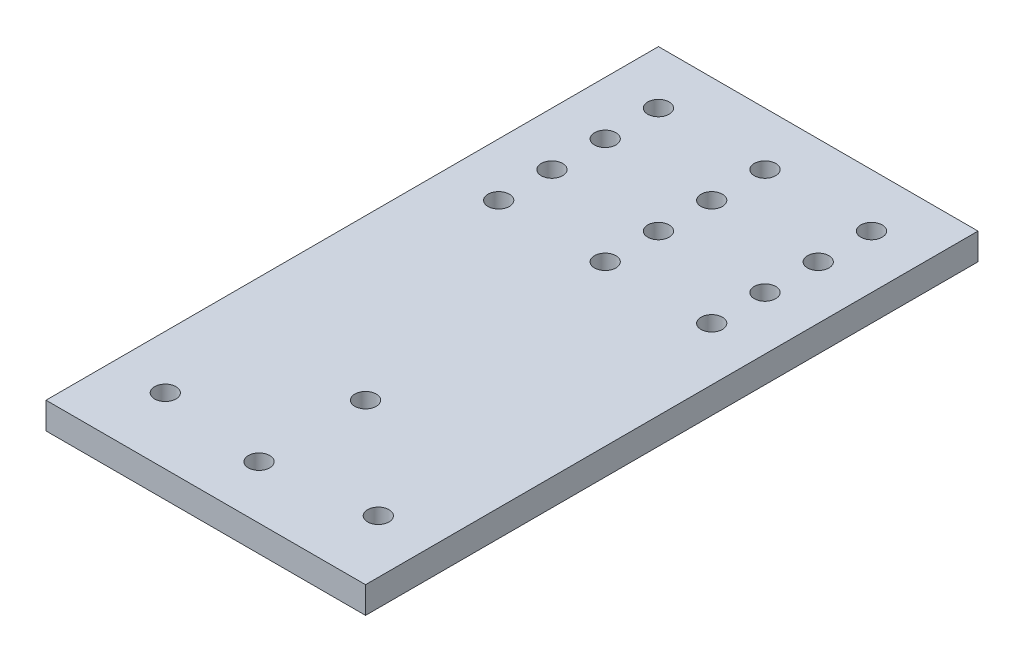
ISO-10303-21;
HEADER;
FILE_DESCRIPTION(('STEP AP214'),'2;1');
FILE_NAME('part.step','',(''),(''),'','','');
FILE_SCHEMA(('AUTOMOTIVE_DESIGN { 1 0 10303 214 1 1 1 1 }'));
ENDSEC;
DATA;
#1=APPLICATION_CONTEXT('core data for automotive mechanical design processes');
#2=APPLICATION_PROTOCOL_DEFINITION('international standard','automotive_design',2000,#1);
#3=PRODUCT_CONTEXT('',#1,'mechanical');
#4=PRODUCT('Part','Part','',(#3));
#5=PRODUCT_RELATED_PRODUCT_CATEGORY('part','',(#4));
#6=PRODUCT_DEFINITION_FORMATION('','',#4);
#7=PRODUCT_DEFINITION_CONTEXT('part definition',#1,'design');
#8=PRODUCT_DEFINITION('design','',#6,#7);
#9=PRODUCT_DEFINITION_SHAPE('','',#8);
#10=(LENGTH_UNIT() NAMED_UNIT(*) SI_UNIT(.MILLI.,.METRE.));
#11=(NAMED_UNIT(*) PLANE_ANGLE_UNIT() SI_UNIT($,.RADIAN.));
#12=(NAMED_UNIT(*) SI_UNIT($,.STERADIAN.) SOLID_ANGLE_UNIT());
#13=UNCERTAINTY_MEASURE_WITH_UNIT(LENGTH_MEASURE(1.E-05),#10,'distance_accuracy_value','');
#14=(GEOMETRIC_REPRESENTATION_CONTEXT(3) GLOBAL_UNCERTAINTY_ASSIGNED_CONTEXT((#13)) GLOBAL_UNIT_ASSIGNED_CONTEXT((#10,
#11,#12)) REPRESENTATION_CONTEXT('',''));
#15=CARTESIAN_POINT('',(0.,0.,0.));
#16=DIRECTION('',(0.,0.,1.));
#17=DIRECTION('',(1.,0.,0.));
#18=AXIS2_PLACEMENT_3D('',#15,#16,#17);
#19=CARTESIAN_POINT('',(38.1,6.35,73.025));
#20=DIRECTION('',(-1.,0.,0.));
#21=DIRECTION('',(0.,0.,1.));
#22=AXIS2_PLACEMENT_3D('',#19,#20,#21);
#23=PLANE('',#22);
#24=DIRECTION('',(0.,0.,-1.));
#25=VECTOR('',#24,1.);
#26=CARTESIAN_POINT('',(38.1,0.,73.025));
#27=LINE('',#26,#25);
#28=CARTESIAN_POINT('',(38.1,0.,73.025));
#29=VERTEX_POINT('',#28);
#30=CARTESIAN_POINT('',(38.1,0.,-73.025));
#31=VERTEX_POINT('',#30);
#32=EDGE_CURVE('E100',#29,#31,#27,.T.);
#33=ORIENTED_EDGE('',*,*,#32,.T.);
#34=DIRECTION('',(0.,-1.,0.));
#35=VECTOR('',#34,1.);
#36=CARTESIAN_POINT('',(38.1,6.35,-73.025));
#37=LINE('',#36,#35);
#38=CARTESIAN_POINT('',(38.1,6.35,-73.025));
#39=VERTEX_POINT('',#38);
#40=EDGE_CURVE('E11',#39,#31,#37,.T.);
#41=ORIENTED_EDGE('',*,*,#40,.F.);
#42=DIRECTION('',(0.,0.,-1.));
#43=VECTOR('',#42,1.);
#44=CARTESIAN_POINT('',(38.1,6.35,73.025));
#45=LINE('',#44,#43);
#46=CARTESIAN_POINT('',(38.1,6.35,73.025));
#47=VERTEX_POINT('',#46);
#48=EDGE_CURVE('E88',#47,#39,#45,.T.);
#49=ORIENTED_EDGE('',*,*,#48,.F.);
#50=DIRECTION('',(0.,-1.,0.));
#51=VECTOR('',#50,1.);
#52=CARTESIAN_POINT('',(38.1,6.35,73.025));
#53=LINE('',#52,#51);
#54=EDGE_CURVE('E96',#47,#29,#53,.T.);
#55=ORIENTED_EDGE('',*,*,#54,.T.);
#56=EDGE_LOOP('',(#33,#41,#49,#55));
#57=FACE_BOUND('',#56,.T.);
#58=ADVANCED_FACE('F37',(#57),#23,.F.);
#59=CARTESIAN_POINT('',(-38.1,6.35,-73.025));
#60=DIRECTION('',(0.,0.,1.));
#61=DIRECTION('',(1.,0.,0.));
#62=AXIS2_PLACEMENT_3D('',#59,#60,#61);
#63=PLANE('',#62);
#64=DIRECTION('',(-1.,0.,0.));
#65=VECTOR('',#64,1.);
#66=CARTESIAN_POINT('',(-38.1,0.,-73.025));
#67=LINE('',#66,#65);
#68=CARTESIAN_POINT('',(-38.1,0.,-73.025));
#69=VERTEX_POINT('',#68);
#70=EDGE_CURVE('E92',#31,#69,#67,.T.);
#71=ORIENTED_EDGE('',*,*,#70,.T.);
#72=DIRECTION('',(0.,-1.,0.));
#73=VECTOR('',#72,1.);
#74=CARTESIAN_POINT('',(-38.1,6.35,-73.025));
#75=LINE('',#74,#73);
#76=CARTESIAN_POINT('',(-38.1,6.35,-73.025));
#77=VERTEX_POINT('',#76);
#78=EDGE_CURVE('E45',#77,#69,#75,.T.);
#79=ORIENTED_EDGE('',*,*,#78,.F.);
#80=DIRECTION('',(-1.,0.,0.));
#81=VECTOR('',#80,1.);
#82=CARTESIAN_POINT('',(-38.1,6.35,-73.025));
#83=LINE('',#82,#81);
#84=EDGE_CURVE('E83',#39,#77,#83,.T.);
#85=ORIENTED_EDGE('',*,*,#84,.F.);
#86=ORIENTED_EDGE('',*,*,#40,.T.);
#87=EDGE_LOOP('',(#71,#79,#85,#86));
#88=FACE_BOUND('',#87,.T.);
#89=ADVANCED_FACE('F91',(#88),#63,.F.);
#90=CARTESIAN_POINT('',(-38.1,6.35,73.025));
#91=DIRECTION('',(1.,0.,0.));
#92=DIRECTION('',(0.,0.,-1.));
#93=AXIS2_PLACEMENT_3D('',#90,#91,#92);
#94=PLANE('',#93);
#95=DIRECTION('',(0.,0.,1.));
#96=VECTOR('',#95,1.);
#97=CARTESIAN_POINT('',(-38.1,0.,73.025));
#98=LINE('',#97,#96);
#99=CARTESIAN_POINT('',(-38.1,0.,73.025));
#100=VERTEX_POINT('',#99);
#101=EDGE_CURVE('E70',#69,#100,#98,.T.);
#102=ORIENTED_EDGE('',*,*,#101,.T.);
#103=DIRECTION('',(0.,-1.,0.));
#104=VECTOR('',#103,1.);
#105=CARTESIAN_POINT('',(-38.1,6.35,73.025));
#106=LINE('',#105,#104);
#107=CARTESIAN_POINT('',(-38.1,6.35,73.025));
#108=VERTEX_POINT('',#107);
#109=EDGE_CURVE('E93',#108,#100,#106,.T.);
#110=ORIENTED_EDGE('',*,*,#109,.F.);
#111=DIRECTION('',(0.,0.,1.));
#112=VECTOR('',#111,1.);
#113=CARTESIAN_POINT('',(-38.1,6.35,73.025));
#114=LINE('',#113,#112);
#115=EDGE_CURVE('E86',#77,#108,#114,.T.);
#116=ORIENTED_EDGE('',*,*,#115,.F.);
#117=ORIENTED_EDGE('',*,*,#78,.T.);
#118=EDGE_LOOP('',(#102,#110,#116,#117));
#119=FACE_BOUND('',#118,.T.);
#120=ADVANCED_FACE('F94',(#119),#94,.F.);
#121=CARTESIAN_POINT('',(-38.1,6.35,73.025));
#122=DIRECTION('',(0.,0.,-1.));
#123=DIRECTION('',(-1.,0.,0.));
#124=AXIS2_PLACEMENT_3D('',#121,#122,#123);
#125=PLANE('',#124);
#126=DIRECTION('',(1.,0.,0.));
#127=VECTOR('',#126,1.);
#128=CARTESIAN_POINT('',(-38.1,0.,73.025));
#129=LINE('',#128,#127);
#130=EDGE_CURVE('E76',#100,#29,#129,.T.);
#131=ORIENTED_EDGE('',*,*,#130,.T.);
#132=ORIENTED_EDGE('',*,*,#54,.F.);
#133=DIRECTION('',(1.,0.,0.));
#134=VECTOR('',#133,1.);
#135=CARTESIAN_POINT('',(-38.1,6.35,73.025));
#136=LINE('',#135,#134);
#137=EDGE_CURVE('E53',#108,#47,#136,.T.);
#138=ORIENTED_EDGE('',*,*,#137,.F.);
#139=ORIENTED_EDGE('',*,*,#109,.T.);
#140=EDGE_LOOP('',(#131,#132,#138,#139));
#141=FACE_BOUND('',#140,.T.);
#142=ADVANCED_FACE('F108',(#141),#125,.F.);
#143=CARTESIAN_POINT('',(0.,6.35,0.));
#144=DIRECTION('',(0.,-1.,0.));
#145=DIRECTION('',(0.,0.,-1.));
#146=AXIS2_PLACEMENT_3D('',#143,#144,#145);
#147=PLANE('',#146);
#148=CARTESIAN_POINT('',(0.,6.35,60.325));
#149=DIRECTION('',(0.,1.,0.));
#150=DIRECTION('',(0.,0.,1.));
#151=AXIS2_PLACEMENT_3D('',#148,#149,#150);
#152=CIRCLE('',#151,2.5527);
#153=CARTESIAN_POINT('',(0.,6.35,62.8777));
#154=VERTEX_POINT('',#153);
#155=EDGE_CURVE('E206',#154,#154,#152,.T.);
#156=ORIENTED_EDGE('',*,*,#155,.F.);
#157=EDGE_LOOP('',(#156));
#158=FACE_BOUND('',#157,.T.);
#159=CARTESIAN_POINT('',(0.,6.35,34.925));
#160=DIRECTION('',(0.,1.,0.));
#161=DIRECTION('',(0.,0.,1.));
#162=AXIS2_PLACEMENT_3D('',#159,#160,#161);
#163=CIRCLE('',#162,2.5527);
#164=CARTESIAN_POINT('',(0.,6.35,37.4777));
#165=VERTEX_POINT('',#164);
#166=EDGE_CURVE('E200',#165,#165,#163,.T.);
#167=ORIENTED_EDGE('',*,*,#166,.F.);
#168=EDGE_LOOP('',(#167));
#169=FACE_BOUND('',#168,.T.);
#170=CARTESIAN_POINT('',(-25.4,6.35,57.277));
#171=DIRECTION('',(0.,1.,0.));
#172=DIRECTION('',(0.,0.,1.));
#173=AXIS2_PLACEMENT_3D('',#170,#171,#172);
#174=CIRCLE('',#173,2.5527);
#175=CARTESIAN_POINT('',(-25.4,6.35,59.8297));
#176=VERTEX_POINT('',#175);
#177=EDGE_CURVE('E194',#176,#176,#174,.T.);
#178=ORIENTED_EDGE('',*,*,#177,.F.);
#179=EDGE_LOOP('',(#178));
#180=FACE_BOUND('',#179,.T.);
#181=CARTESIAN_POINT('',(25.4,6.35,57.277));
#182=DIRECTION('',(0.,1.,0.));
#183=DIRECTION('',(0.,0.,1.));
#184=AXIS2_PLACEMENT_3D('',#181,#182,#183);
#185=CIRCLE('',#184,2.5527);
#186=CARTESIAN_POINT('',(25.4,6.35,59.8297));
#187=VERTEX_POINT('',#186);
#188=EDGE_CURVE('E188',#187,#187,#185,.T.);
#189=ORIENTED_EDGE('',*,*,#188,.F.);
#190=EDGE_LOOP('',(#189));
#191=FACE_BOUND('',#190,.T.);
#192=CARTESIAN_POINT('',(0.,6.35,-22.225));
#193=DIRECTION('',(0.,1.,0.));
#194=DIRECTION('',(0.,0.,1.));
#195=AXIS2_PLACEMENT_3D('',#192,#193,#194);
#196=CIRCLE('',#195,2.5527);
#197=CARTESIAN_POINT('',(0.,6.35,-19.6723));
#198=VERTEX_POINT('',#197);
#199=EDGE_CURVE('E182',#198,#198,#196,.T.);
#200=ORIENTED_EDGE('',*,*,#199,.F.);
#201=EDGE_LOOP('',(#200));
#202=FACE_BOUND('',#201,.T.);
#203=CARTESIAN_POINT('',(0.,6.35,-34.925));
#204=DIRECTION('',(0.,1.,0.));
#205=DIRECTION('',(0.,0.,1.));
#206=AXIS2_PLACEMENT_3D('',#203,#204,#205);
#207=CIRCLE('',#206,2.5527);
#208=CARTESIAN_POINT('',(0.,6.35,-32.3723));
#209=VERTEX_POINT('',#208);
#210=EDGE_CURVE('E176',#209,#209,#207,.T.);
#211=ORIENTED_EDGE('',*,*,#210,.F.);
#212=EDGE_LOOP('',(#211));
#213=FACE_BOUND('',#212,.T.);
#214=CARTESIAN_POINT('',(0.,6.35,-47.625));
#215=DIRECTION('',(0.,1.,0.));
#216=DIRECTION('',(0.,0.,1.));
#217=AXIS2_PLACEMENT_3D('',#214,#215,#216);
#218=CIRCLE('',#217,2.5527);
#219=CARTESIAN_POINT('',(0.,6.35,-45.0723));
#220=VERTEX_POINT('',#219);
#221=EDGE_CURVE('E170',#220,#220,#218,.T.);
#222=ORIENTED_EDGE('',*,*,#221,.F.);
#223=EDGE_LOOP('',(#222));
#224=FACE_BOUND('',#223,.T.);
#225=CARTESIAN_POINT('',(0.,6.35,-60.325));
#226=DIRECTION('',(0.,1.,0.));
#227=DIRECTION('',(0.,0.,1.));
#228=AXIS2_PLACEMENT_3D('',#225,#226,#227);
#229=CIRCLE('',#228,2.5527);
#230=CARTESIAN_POINT('',(0.,6.35,-57.7723));
#231=VERTEX_POINT('',#230);
#232=EDGE_CURVE('E164',#231,#231,#229,.T.);
#233=ORIENTED_EDGE('',*,*,#232,.F.);
#234=EDGE_LOOP('',(#233));
#235=FACE_BOUND('',#234,.T.);
#236=CARTESIAN_POINT('',(-25.4,6.35,-60.325));
#237=DIRECTION('',(0.,1.,0.));
#238=DIRECTION('',(0.,0.,1.));
#239=AXIS2_PLACEMENT_3D('',#236,#237,#238);
#240=CIRCLE('',#239,2.5527);
#241=CARTESIAN_POINT('',(-25.4,6.35,-57.7723));
#242=VERTEX_POINT('',#241);
#243=EDGE_CURVE('E158',#242,#242,#240,.T.);
#244=ORIENTED_EDGE('',*,*,#243,.F.);
#245=EDGE_LOOP('',(#244));
#246=FACE_BOUND('',#245,.T.);
#247=CARTESIAN_POINT('',(-25.4,6.35,-47.625));
#248=DIRECTION('',(0.,1.,0.));
#249=DIRECTION('',(0.,0.,1.));
#250=AXIS2_PLACEMENT_3D('',#247,#248,#249);
#251=CIRCLE('',#250,2.5527);
#252=CARTESIAN_POINT('',(-25.4,6.35,-45.0723));
#253=VERTEX_POINT('',#252);
#254=EDGE_CURVE('E152',#253,#253,#251,.T.);
#255=ORIENTED_EDGE('',*,*,#254,.F.);
#256=EDGE_LOOP('',(#255));
#257=FACE_BOUND('',#256,.T.);
#258=CARTESIAN_POINT('',(-25.4,6.35,-34.925));
#259=DIRECTION('',(0.,1.,0.));
#260=DIRECTION('',(0.,0.,1.));
#261=AXIS2_PLACEMENT_3D('',#258,#259,#260);
#262=CIRCLE('',#261,2.5527);
#263=CARTESIAN_POINT('',(-25.4,6.35,-32.3723));
#264=VERTEX_POINT('',#263);
#265=EDGE_CURVE('E146',#264,#264,#262,.T.);
#266=ORIENTED_EDGE('',*,*,#265,.F.);
#267=EDGE_LOOP('',(#266));
#268=FACE_BOUND('',#267,.T.);
#269=CARTESIAN_POINT('',(-25.4,6.35,-22.225));
#270=DIRECTION('',(0.,1.,0.));
#271=DIRECTION('',(0.,0.,1.));
#272=AXIS2_PLACEMENT_3D('',#269,#270,#271);
#273=CIRCLE('',#272,2.5527);
#274=CARTESIAN_POINT('',(-25.4,6.35,-19.6723));
#275=VERTEX_POINT('',#274);
#276=EDGE_CURVE('E140',#275,#275,#273,.T.);
#277=ORIENTED_EDGE('',*,*,#276,.F.);
#278=EDGE_LOOP('',(#277));
#279=FACE_BOUND('',#278,.T.);
#280=CARTESIAN_POINT('',(25.4,6.35,-22.225));
#281=DIRECTION('',(0.,1.,0.));
#282=DIRECTION('',(0.,0.,1.));
#283=AXIS2_PLACEMENT_3D('',#280,#281,#282);
#284=CIRCLE('',#283,2.5527);
#285=CARTESIAN_POINT('',(25.4,6.35,-19.6723));
#286=VERTEX_POINT('',#285);
#287=EDGE_CURVE('E134',#286,#286,#284,.T.);
#288=ORIENTED_EDGE('',*,*,#287,.F.);
#289=EDGE_LOOP('',(#288));
#290=FACE_BOUND('',#289,.T.);
#291=CARTESIAN_POINT('',(25.4,6.35,-34.925));
#292=DIRECTION('',(0.,1.,0.));
#293=DIRECTION('',(0.,0.,1.));
#294=AXIS2_PLACEMENT_3D('',#291,#292,#293);
#295=CIRCLE('',#294,2.5527);
#296=CARTESIAN_POINT('',(25.4,6.35,-32.3723));
#297=VERTEX_POINT('',#296);
#298=EDGE_CURVE('E128',#297,#297,#295,.T.);
#299=ORIENTED_EDGE('',*,*,#298,.F.);
#300=EDGE_LOOP('',(#299));
#301=FACE_BOUND('',#300,.T.);
#302=CARTESIAN_POINT('',(25.4,6.35,-47.625));
#303=DIRECTION('',(0.,1.,0.));
#304=DIRECTION('',(0.,0.,1.));
#305=AXIS2_PLACEMENT_3D('',#302,#303,#304);
#306=CIRCLE('',#305,2.5527);
#307=CARTESIAN_POINT('',(25.4,6.35,-45.0723));
#308=VERTEX_POINT('',#307);
#309=EDGE_CURVE('E122',#308,#308,#306,.T.);
#310=ORIENTED_EDGE('',*,*,#309,.F.);
#311=EDGE_LOOP('',(#310));
#312=FACE_BOUND('',#311,.T.);
#313=CARTESIAN_POINT('',(25.4,6.35,-60.325));
#314=DIRECTION('',(0.,1.,0.));
#315=DIRECTION('',(0.,0.,1.));
#316=AXIS2_PLACEMENT_3D('',#313,#314,#315);
#317=CIRCLE('',#316,2.5527);
#318=CARTESIAN_POINT('',(25.4,6.35,-57.7723));
#319=VERTEX_POINT('',#318);
#320=EDGE_CURVE('E116',#319,#319,#317,.T.);
#321=ORIENTED_EDGE('',*,*,#320,.F.);
#322=EDGE_LOOP('',(#321));
#323=FACE_BOUND('',#322,.T.);
#324=ORIENTED_EDGE('',*,*,#48,.T.);
#325=ORIENTED_EDGE('',*,*,#84,.T.);
#326=ORIENTED_EDGE('',*,*,#115,.T.);
#327=ORIENTED_EDGE('',*,*,#137,.T.);
#328=EDGE_LOOP('',(#324,#325,#326,#327));
#329=FACE_BOUND('',#328,.T.);
#330=ADVANCED_FACE('F84',(#158,#169,#180,#191,#202,#213,#224,#235,#246,#257,#268,#279,#290,#301,
#312,#323,#329),#147,.F.);
#331=CARTESIAN_POINT('',(0.,0.,0.));
#332=DIRECTION('',(0.,-1.,0.));
#333=DIRECTION('',(0.,0.,-1.));
#334=AXIS2_PLACEMENT_3D('',#331,#332,#333);
#335=PLANE('',#334);
#336=CARTESIAN_POINT('',(0.,0.,60.325));
#337=DIRECTION('',(0.,1.,0.));
#338=DIRECTION('',(0.,0.,1.));
#339=AXIS2_PLACEMENT_3D('',#336,#337,#338);
#340=CIRCLE('',#339,2.5527);
#341=CARTESIAN_POINT('',(0.,0.,62.8777));
#342=VERTEX_POINT('',#341);
#343=EDGE_CURVE('E203',#342,#342,#340,.T.);
#344=ORIENTED_EDGE('',*,*,#343,.T.);
#345=EDGE_LOOP('',(#344));
#346=FACE_BOUND('',#345,.T.);
#347=CARTESIAN_POINT('',(0.,0.,34.925));
#348=DIRECTION('',(0.,1.,0.));
#349=DIRECTION('',(0.,0.,1.));
#350=AXIS2_PLACEMENT_3D('',#347,#348,#349);
#351=CIRCLE('',#350,2.5527);
#352=CARTESIAN_POINT('',(0.,0.,37.4777));
#353=VERTEX_POINT('',#352);
#354=EDGE_CURVE('E197',#353,#353,#351,.T.);
#355=ORIENTED_EDGE('',*,*,#354,.T.);
#356=EDGE_LOOP('',(#355));
#357=FACE_BOUND('',#356,.T.);
#358=CARTESIAN_POINT('',(-25.4,0.,57.277));
#359=DIRECTION('',(0.,1.,0.));
#360=DIRECTION('',(0.,0.,1.));
#361=AXIS2_PLACEMENT_3D('',#358,#359,#360);
#362=CIRCLE('',#361,2.5527);
#363=CARTESIAN_POINT('',(-25.4,0.,59.8297));
#364=VERTEX_POINT('',#363);
#365=EDGE_CURVE('E191',#364,#364,#362,.T.);
#366=ORIENTED_EDGE('',*,*,#365,.T.);
#367=EDGE_LOOP('',(#366));
#368=FACE_BOUND('',#367,.T.);
#369=CARTESIAN_POINT('',(25.4,0.,57.277));
#370=DIRECTION('',(0.,1.,0.));
#371=DIRECTION('',(0.,0.,1.));
#372=AXIS2_PLACEMENT_3D('',#369,#370,#371);
#373=CIRCLE('',#372,2.5527);
#374=CARTESIAN_POINT('',(25.4,0.,59.8297));
#375=VERTEX_POINT('',#374);
#376=EDGE_CURVE('E185',#375,#375,#373,.T.);
#377=ORIENTED_EDGE('',*,*,#376,.T.);
#378=EDGE_LOOP('',(#377));
#379=FACE_BOUND('',#378,.T.);
#380=CARTESIAN_POINT('',(0.,0.,-22.225));
#381=DIRECTION('',(0.,1.,0.));
#382=DIRECTION('',(0.,0.,1.));
#383=AXIS2_PLACEMENT_3D('',#380,#381,#382);
#384=CIRCLE('',#383,2.5527);
#385=CARTESIAN_POINT('',(0.,0.,-19.6723));
#386=VERTEX_POINT('',#385);
#387=EDGE_CURVE('E179',#386,#386,#384,.T.);
#388=ORIENTED_EDGE('',*,*,#387,.T.);
#389=EDGE_LOOP('',(#388));
#390=FACE_BOUND('',#389,.T.);
#391=CARTESIAN_POINT('',(0.,0.,-34.925));
#392=DIRECTION('',(0.,1.,0.));
#393=DIRECTION('',(0.,0.,1.));
#394=AXIS2_PLACEMENT_3D('',#391,#392,#393);
#395=CIRCLE('',#394,2.5527);
#396=CARTESIAN_POINT('',(0.,0.,-32.3723));
#397=VERTEX_POINT('',#396);
#398=EDGE_CURVE('E173',#397,#397,#395,.T.);
#399=ORIENTED_EDGE('',*,*,#398,.T.);
#400=EDGE_LOOP('',(#399));
#401=FACE_BOUND('',#400,.T.);
#402=CARTESIAN_POINT('',(0.,0.,-47.625));
#403=DIRECTION('',(0.,1.,0.));
#404=DIRECTION('',(0.,0.,1.));
#405=AXIS2_PLACEMENT_3D('',#402,#403,#404);
#406=CIRCLE('',#405,2.5527);
#407=CARTESIAN_POINT('',(0.,0.,-45.0723));
#408=VERTEX_POINT('',#407);
#409=EDGE_CURVE('E167',#408,#408,#406,.T.);
#410=ORIENTED_EDGE('',*,*,#409,.T.);
#411=EDGE_LOOP('',(#410));
#412=FACE_BOUND('',#411,.T.);
#413=CARTESIAN_POINT('',(0.,0.,-60.325));
#414=DIRECTION('',(0.,1.,0.));
#415=DIRECTION('',(0.,0.,1.));
#416=AXIS2_PLACEMENT_3D('',#413,#414,#415);
#417=CIRCLE('',#416,2.5527);
#418=CARTESIAN_POINT('',(0.,0.,-57.7723));
#419=VERTEX_POINT('',#418);
#420=EDGE_CURVE('E161',#419,#419,#417,.T.);
#421=ORIENTED_EDGE('',*,*,#420,.T.);
#422=EDGE_LOOP('',(#421));
#423=FACE_BOUND('',#422,.T.);
#424=CARTESIAN_POINT('',(-25.4,0.,-60.325));
#425=DIRECTION('',(0.,1.,0.));
#426=DIRECTION('',(0.,0.,1.));
#427=AXIS2_PLACEMENT_3D('',#424,#425,#426);
#428=CIRCLE('',#427,2.5527);
#429=CARTESIAN_POINT('',(-25.4,0.,-57.7723));
#430=VERTEX_POINT('',#429);
#431=EDGE_CURVE('E155',#430,#430,#428,.T.);
#432=ORIENTED_EDGE('',*,*,#431,.T.);
#433=EDGE_LOOP('',(#432));
#434=FACE_BOUND('',#433,.T.);
#435=CARTESIAN_POINT('',(-25.4,0.,-47.625));
#436=DIRECTION('',(0.,1.,0.));
#437=DIRECTION('',(0.,0.,1.));
#438=AXIS2_PLACEMENT_3D('',#435,#436,#437);
#439=CIRCLE('',#438,2.5527);
#440=CARTESIAN_POINT('',(-25.4,0.,-45.0723));
#441=VERTEX_POINT('',#440);
#442=EDGE_CURVE('E149',#441,#441,#439,.T.);
#443=ORIENTED_EDGE('',*,*,#442,.T.);
#444=EDGE_LOOP('',(#443));
#445=FACE_BOUND('',#444,.T.);
#446=CARTESIAN_POINT('',(-25.4,0.,-34.925));
#447=DIRECTION('',(0.,1.,0.));
#448=DIRECTION('',(0.,0.,1.));
#449=AXIS2_PLACEMENT_3D('',#446,#447,#448);
#450=CIRCLE('',#449,2.5527);
#451=CARTESIAN_POINT('',(-25.4,0.,-32.3723));
#452=VERTEX_POINT('',#451);
#453=EDGE_CURVE('E143',#452,#452,#450,.T.);
#454=ORIENTED_EDGE('',*,*,#453,.T.);
#455=EDGE_LOOP('',(#454));
#456=FACE_BOUND('',#455,.T.);
#457=CARTESIAN_POINT('',(-25.4,0.,-22.225));
#458=DIRECTION('',(0.,1.,0.));
#459=DIRECTION('',(0.,0.,1.));
#460=AXIS2_PLACEMENT_3D('',#457,#458,#459);
#461=CIRCLE('',#460,2.5527);
#462=CARTESIAN_POINT('',(-25.4,0.,-19.6723));
#463=VERTEX_POINT('',#462);
#464=EDGE_CURVE('E137',#463,#463,#461,.T.);
#465=ORIENTED_EDGE('',*,*,#464,.T.);
#466=EDGE_LOOP('',(#465));
#467=FACE_BOUND('',#466,.T.);
#468=CARTESIAN_POINT('',(25.4,0.,-22.225));
#469=DIRECTION('',(0.,1.,0.));
#470=DIRECTION('',(0.,0.,1.));
#471=AXIS2_PLACEMENT_3D('',#468,#469,#470);
#472=CIRCLE('',#471,2.5527);
#473=CARTESIAN_POINT('',(25.4,0.,-19.6723));
#474=VERTEX_POINT('',#473);
#475=EDGE_CURVE('E131',#474,#474,#472,.T.);
#476=ORIENTED_EDGE('',*,*,#475,.T.);
#477=EDGE_LOOP('',(#476));
#478=FACE_BOUND('',#477,.T.);
#479=CARTESIAN_POINT('',(25.4,0.,-34.925));
#480=DIRECTION('',(0.,1.,0.));
#481=DIRECTION('',(0.,0.,1.));
#482=AXIS2_PLACEMENT_3D('',#479,#480,#481);
#483=CIRCLE('',#482,2.5527);
#484=CARTESIAN_POINT('',(25.4,0.,-32.3723));
#485=VERTEX_POINT('',#484);
#486=EDGE_CURVE('E125',#485,#485,#483,.T.);
#487=ORIENTED_EDGE('',*,*,#486,.T.);
#488=EDGE_LOOP('',(#487));
#489=FACE_BOUND('',#488,.T.);
#490=CARTESIAN_POINT('',(25.4,0.,-47.625));
#491=DIRECTION('',(0.,1.,0.));
#492=DIRECTION('',(0.,0.,1.));
#493=AXIS2_PLACEMENT_3D('',#490,#491,#492);
#494=CIRCLE('',#493,2.5527);
#495=CARTESIAN_POINT('',(25.4,0.,-45.0723));
#496=VERTEX_POINT('',#495);
#497=EDGE_CURVE('E119',#496,#496,#494,.T.);
#498=ORIENTED_EDGE('',*,*,#497,.T.);
#499=EDGE_LOOP('',(#498));
#500=FACE_BOUND('',#499,.T.);
#501=CARTESIAN_POINT('',(25.4,0.,-60.325));
#502=DIRECTION('',(0.,1.,0.));
#503=DIRECTION('',(0.,0.,1.));
#504=AXIS2_PLACEMENT_3D('',#501,#502,#503);
#505=CIRCLE('',#504,2.5527);
#506=CARTESIAN_POINT('',(25.4,0.,-57.7723));
#507=VERTEX_POINT('',#506);
#508=EDGE_CURVE('E103',#507,#507,#505,.T.);
#509=ORIENTED_EDGE('',*,*,#508,.T.);
#510=EDGE_LOOP('',(#509));
#511=FACE_BOUND('',#510,.T.);
#512=ORIENTED_EDGE('',*,*,#32,.F.);
#513=ORIENTED_EDGE('',*,*,#130,.F.);
#514=ORIENTED_EDGE('',*,*,#101,.F.);
#515=ORIENTED_EDGE('',*,*,#70,.F.);
#516=EDGE_LOOP('',(#512,#513,#514,#515));
#517=FACE_BOUND('',#516,.T.);
#518=ADVANCED_FACE('F111',(#346,#357,#368,#379,#390,#401,#412,#423,#434,#445,#456,#467,#478,
#489,#500,#511,#517),#335,.T.);
#519=CARTESIAN_POINT('',(25.4,6.35,-60.325));
#520=DIRECTION('',(0.,1.,0.));
#521=DIRECTION('',(0.,0.,1.));
#522=AXIS2_PLACEMENT_3D('',#519,#520,#521);
#523=CYLINDRICAL_SURFACE('',#522,2.5527);
#524=ORIENTED_EDGE('',*,*,#508,.F.);
#525=EDGE_LOOP('',(#524));
#526=FACE_BOUND('',#525,.T.);
#527=ORIENTED_EDGE('',*,*,#320,.T.);
#528=EDGE_LOOP('',(#527));
#529=FACE_BOUND('',#528,.T.);
#530=ADVANCED_FACE('F245',(#526,#529),#523,.F.);
#531=CARTESIAN_POINT('',(25.4,6.35,-47.625));
#532=DIRECTION('',(0.,1.,0.));
#533=DIRECTION('',(0.,0.,1.));
#534=AXIS2_PLACEMENT_3D('',#531,#532,#533);
#535=CYLINDRICAL_SURFACE('',#534,2.5527);
#536=ORIENTED_EDGE('',*,*,#497,.F.);
#537=EDGE_LOOP('',(#536));
#538=FACE_BOUND('',#537,.T.);
#539=ORIENTED_EDGE('',*,*,#309,.T.);
#540=EDGE_LOOP('',(#539));
#541=FACE_BOUND('',#540,.T.);
#542=ADVANCED_FACE('F247',(#538,#541),#535,.F.);
#543=CARTESIAN_POINT('',(25.4,6.35,-34.925));
#544=DIRECTION('',(0.,1.,0.));
#545=DIRECTION('',(0.,0.,1.));
#546=AXIS2_PLACEMENT_3D('',#543,#544,#545);
#547=CYLINDRICAL_SURFACE('',#546,2.5527);
#548=ORIENTED_EDGE('',*,*,#486,.F.);
#549=EDGE_LOOP('',(#548));
#550=FACE_BOUND('',#549,.T.);
#551=ORIENTED_EDGE('',*,*,#298,.T.);
#552=EDGE_LOOP('',(#551));
#553=FACE_BOUND('',#552,.T.);
#554=ADVANCED_FACE('F254',(#550,#553),#547,.F.);
#555=CARTESIAN_POINT('',(25.4,6.35,-22.225));
#556=DIRECTION('',(0.,1.,0.));
#557=DIRECTION('',(0.,0.,1.));
#558=AXIS2_PLACEMENT_3D('',#555,#556,#557);
#559=CYLINDRICAL_SURFACE('',#558,2.5527);
#560=ORIENTED_EDGE('',*,*,#475,.F.);
#561=EDGE_LOOP('',(#560));
#562=FACE_BOUND('',#561,.T.);
#563=ORIENTED_EDGE('',*,*,#287,.T.);
#564=EDGE_LOOP('',(#563));
#565=FACE_BOUND('',#564,.T.);
#566=ADVANCED_FACE('F304',(#562,#565),#559,.F.);
#567=CARTESIAN_POINT('',(-25.4,6.35,-22.225));
#568=DIRECTION('',(0.,1.,0.));
#569=DIRECTION('',(0.,0.,1.));
#570=AXIS2_PLACEMENT_3D('',#567,#568,#569);
#571=CYLINDRICAL_SURFACE('',#570,2.5527);
#572=ORIENTED_EDGE('',*,*,#464,.F.);
#573=EDGE_LOOP('',(#572));
#574=FACE_BOUND('',#573,.T.);
#575=ORIENTED_EDGE('',*,*,#276,.T.);
#576=EDGE_LOOP('',(#575));
#577=FACE_BOUND('',#576,.T.);
#578=ADVANCED_FACE('F315',(#574,#577),#571,.F.);
#579=CARTESIAN_POINT('',(-25.4,6.35,-34.925));
#580=DIRECTION('',(0.,1.,0.));
#581=DIRECTION('',(0.,0.,1.));
#582=AXIS2_PLACEMENT_3D('',#579,#580,#581);
#583=CYLINDRICAL_SURFACE('',#582,2.5527);
#584=ORIENTED_EDGE('',*,*,#453,.F.);
#585=EDGE_LOOP('',(#584));
#586=FACE_BOUND('',#585,.T.);
#587=ORIENTED_EDGE('',*,*,#265,.T.);
#588=EDGE_LOOP('',(#587));
#589=FACE_BOUND('',#588,.T.);
#590=ADVANCED_FACE('F326',(#586,#589),#583,.F.);
#591=CARTESIAN_POINT('',(-25.4,6.35,-47.625));
#592=DIRECTION('',(0.,1.,0.));
#593=DIRECTION('',(0.,0.,1.));
#594=AXIS2_PLACEMENT_3D('',#591,#592,#593);
#595=CYLINDRICAL_SURFACE('',#594,2.5527);
#596=ORIENTED_EDGE('',*,*,#442,.F.);
#597=EDGE_LOOP('',(#596));
#598=FACE_BOUND('',#597,.T.);
#599=ORIENTED_EDGE('',*,*,#254,.T.);
#600=EDGE_LOOP('',(#599));
#601=FACE_BOUND('',#600,.T.);
#602=ADVANCED_FACE('F337',(#598,#601),#595,.F.);
#603=CARTESIAN_POINT('',(-25.4,6.35,-60.325));
#604=DIRECTION('',(0.,1.,0.));
#605=DIRECTION('',(0.,0.,1.));
#606=AXIS2_PLACEMENT_3D('',#603,#604,#605);
#607=CYLINDRICAL_SURFACE('',#606,2.5527);
#608=ORIENTED_EDGE('',*,*,#431,.F.);
#609=EDGE_LOOP('',(#608));
#610=FACE_BOUND('',#609,.T.);
#611=ORIENTED_EDGE('',*,*,#243,.T.);
#612=EDGE_LOOP('',(#611));
#613=FACE_BOUND('',#612,.T.);
#614=ADVANCED_FACE('F348',(#610,#613),#607,.F.);
#615=CARTESIAN_POINT('',(0.,6.35,-60.325));
#616=DIRECTION('',(0.,1.,0.));
#617=DIRECTION('',(0.,0.,1.));
#618=AXIS2_PLACEMENT_3D('',#615,#616,#617);
#619=CYLINDRICAL_SURFACE('',#618,2.5527);
#620=ORIENTED_EDGE('',*,*,#420,.F.);
#621=EDGE_LOOP('',(#620));
#622=FACE_BOUND('',#621,.T.);
#623=ORIENTED_EDGE('',*,*,#232,.T.);
#624=EDGE_LOOP('',(#623));
#625=FACE_BOUND('',#624,.T.);
#626=ADVANCED_FACE('F359',(#622,#625),#619,.F.);
#627=CARTESIAN_POINT('',(0.,6.35,-47.625));
#628=DIRECTION('',(0.,1.,0.));
#629=DIRECTION('',(0.,0.,1.));
#630=AXIS2_PLACEMENT_3D('',#627,#628,#629);
#631=CYLINDRICAL_SURFACE('',#630,2.5527);
#632=ORIENTED_EDGE('',*,*,#409,.F.);
#633=EDGE_LOOP('',(#632));
#634=FACE_BOUND('',#633,.T.);
#635=ORIENTED_EDGE('',*,*,#221,.T.);
#636=EDGE_LOOP('',(#635));
#637=FACE_BOUND('',#636,.T.);
#638=ADVANCED_FACE('F370',(#634,#637),#631,.F.);
#639=CARTESIAN_POINT('',(0.,6.35,-34.925));
#640=DIRECTION('',(0.,1.,0.));
#641=DIRECTION('',(0.,0.,1.));
#642=AXIS2_PLACEMENT_3D('',#639,#640,#641);
#643=CYLINDRICAL_SURFACE('',#642,2.5527);
#644=ORIENTED_EDGE('',*,*,#398,.F.);
#645=EDGE_LOOP('',(#644));
#646=FACE_BOUND('',#645,.T.);
#647=ORIENTED_EDGE('',*,*,#210,.T.);
#648=EDGE_LOOP('',(#647));
#649=FACE_BOUND('',#648,.T.);
#650=ADVANCED_FACE('F381',(#646,#649),#643,.F.);
#651=CARTESIAN_POINT('',(0.,6.35,-22.225));
#652=DIRECTION('',(0.,1.,0.));
#653=DIRECTION('',(0.,0.,1.));
#654=AXIS2_PLACEMENT_3D('',#651,#652,#653);
#655=CYLINDRICAL_SURFACE('',#654,2.5527);
#656=ORIENTED_EDGE('',*,*,#387,.F.);
#657=EDGE_LOOP('',(#656));
#658=FACE_BOUND('',#657,.T.);
#659=ORIENTED_EDGE('',*,*,#199,.T.);
#660=EDGE_LOOP('',(#659));
#661=FACE_BOUND('',#660,.T.);
#662=ADVANCED_FACE('F392',(#658,#661),#655,.F.);
#663=CARTESIAN_POINT('',(25.4,6.35,57.277));
#664=DIRECTION('',(0.,1.,0.));
#665=DIRECTION('',(0.,0.,1.));
#666=AXIS2_PLACEMENT_3D('',#663,#664,#665);
#667=CYLINDRICAL_SURFACE('',#666,2.5527);
#668=ORIENTED_EDGE('',*,*,#376,.F.);
#669=EDGE_LOOP('',(#668));
#670=FACE_BOUND('',#669,.T.);
#671=ORIENTED_EDGE('',*,*,#188,.T.);
#672=EDGE_LOOP('',(#671));
#673=FACE_BOUND('',#672,.T.);
#674=ADVANCED_FACE('F403',(#670,#673),#667,.F.);
#675=CARTESIAN_POINT('',(-25.4,6.35,57.277));
#676=DIRECTION('',(0.,1.,0.));
#677=DIRECTION('',(0.,0.,1.));
#678=AXIS2_PLACEMENT_3D('',#675,#676,#677);
#679=CYLINDRICAL_SURFACE('',#678,2.5527);
#680=ORIENTED_EDGE('',*,*,#365,.F.);
#681=EDGE_LOOP('',(#680));
#682=FACE_BOUND('',#681,.T.);
#683=ORIENTED_EDGE('',*,*,#177,.T.);
#684=EDGE_LOOP('',(#683));
#685=FACE_BOUND('',#684,.T.);
#686=ADVANCED_FACE('F414',(#682,#685),#679,.F.);
#687=CARTESIAN_POINT('',(0.,6.35,34.925));
#688=DIRECTION('',(0.,1.,0.));
#689=DIRECTION('',(0.,0.,1.));
#690=AXIS2_PLACEMENT_3D('',#687,#688,#689);
#691=CYLINDRICAL_SURFACE('',#690,2.5527);
#692=ORIENTED_EDGE('',*,*,#354,.F.);
#693=EDGE_LOOP('',(#692));
#694=FACE_BOUND('',#693,.T.);
#695=ORIENTED_EDGE('',*,*,#166,.T.);
#696=EDGE_LOOP('',(#695));
#697=FACE_BOUND('',#696,.T.);
#698=ADVANCED_FACE('F425',(#694,#697),#691,.F.);
#699=CARTESIAN_POINT('',(0.,6.35,60.325));
#700=DIRECTION('',(0.,1.,0.));
#701=DIRECTION('',(0.,0.,1.));
#702=AXIS2_PLACEMENT_3D('',#699,#700,#701);
#703=CYLINDRICAL_SURFACE('',#702,2.5527);
#704=ORIENTED_EDGE('',*,*,#343,.F.);
#705=EDGE_LOOP('',(#704));
#706=FACE_BOUND('',#705,.T.);
#707=ORIENTED_EDGE('',*,*,#155,.T.);
#708=EDGE_LOOP('',(#707));
#709=FACE_BOUND('',#708,.T.);
#710=ADVANCED_FACE('F210',(#706,#709),#703,.F.);
#711=CLOSED_SHELL('',(#58,#89,#120,#142,#330,#518,#530,#542,#554,#566,#578,#590,#602,#614,#626,
#638,#650,#662,#674,#686,#698,#710));
#712=MANIFOLD_SOLID_BREP('B2',#711);
#713=ADVANCED_BREP_SHAPE_REPRESENTATION('',(#18,#712),#14);
#714=SHAPE_DEFINITION_REPRESENTATION(#9,#713);
ENDSEC;
END-ISO-10303-21;
